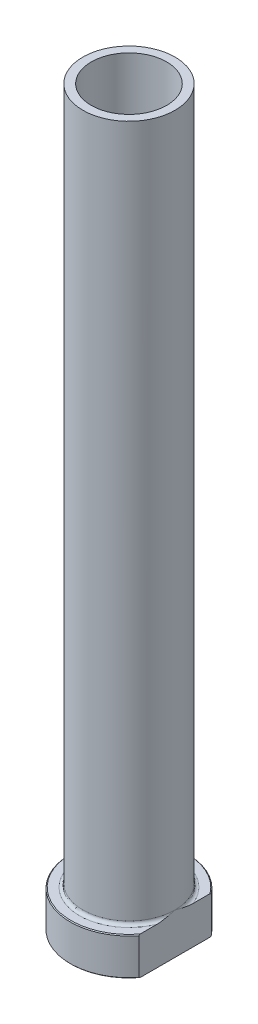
from build123d import *

# Parameters (mm, degrees)
FILLET1_R          = 0.8
CHAMFER1_SIZE      = 0.2
CUT_EXTRUDE1_DEPTH = 177.116438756
CHAMFER2_SIZE      = 0.5


with BuildPart() as part:
    # Sketch1 → Revolve1 (revolve)
    with BuildSketch(Plane.XY, mode=Mode.PRIVATE) as revolve1_sk:
        Polygon((-9, 175), (-11, 175), (-11, 9), (-14, 9), (-14, 0), (-9.25, 0), (-9.25, 108), (-9, 120), align=None)
    revolve(revolve1_sk.sketch.rotate(Axis((0, 92.187680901, 0), (0, -1, 0)), 270), axis=Axis((0, 92.187680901, 0), (0, -1, 0)))

    # Fillet1
    fillet1_edges = [part.edges().sort_by_distance(p)[0] for p in [
        (0, 9, -11),
    ]]
    fillet(fillet1_edges, radius=FILLET1_R)

    # Chamfer1
    chamfer1_edges = [part.edges().sort_by_distance(p)[0] for p in [
        (0, 0, -14),
        (0, 9, -14),
    ]]
    chamfer(chamfer1_edges, length=CHAMFER1_SIZE)

    # Sketch2 → Cut-Extrude1 (cut, through all)
    with BuildSketch(Plane.XZ):
        with BuildLine():
            Line((11, 8.660254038), (11, -8.660254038))
            ThreePointArc((11, -8.660254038), (14, 0), (11, 8.660254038))
        make_face()
    extrude(amount=-CUT_EXTRUDE1_DEPTH, mode=Mode.SUBTRACT)

    # Chamfer2
    chamfer2_edges = [part.edges().sort_by_distance(p)[0] for p in [
        (0, 0, -9.25),
    ]]
    chamfer(chamfer2_edges, length=CHAMFER2_SIZE)


solid = part.part
